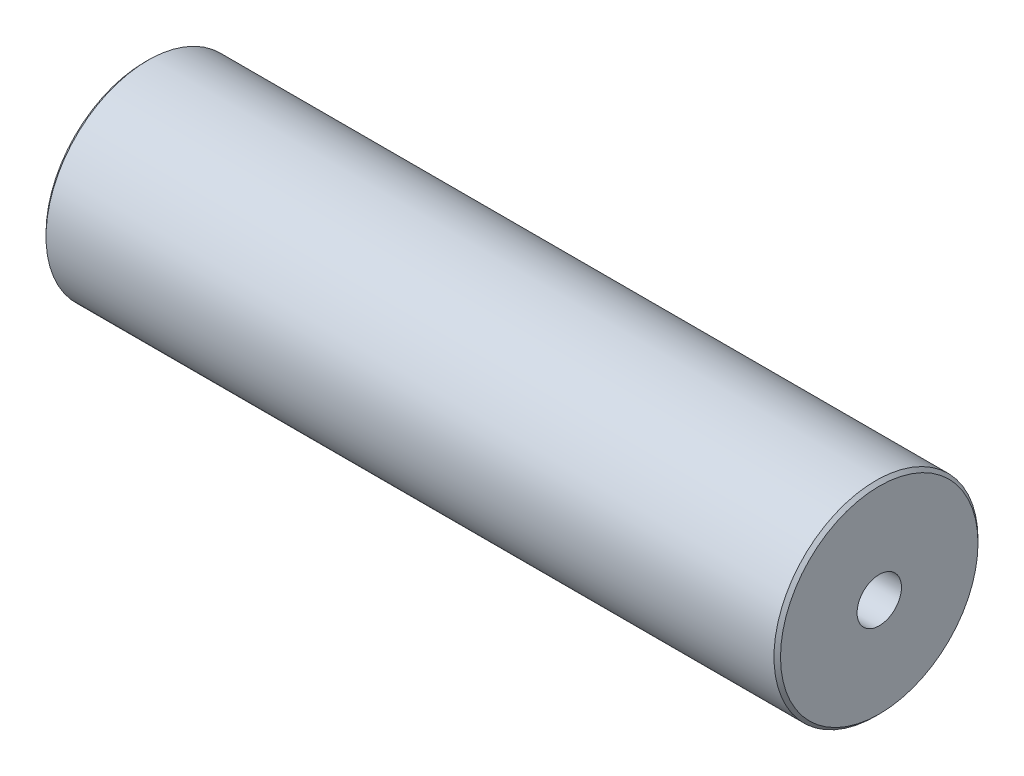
from build123d import *

# Parameters (mm, degrees)
SKETCH1_R           = 7.9375
BOSS_EXTRUDE1_DEPTH = 28.575
CHAMFER1_SIZE       = 0.254


with BuildPart() as part:
    # Sketch1 → Boss-Extrude1 (new, symmetric)
    with BuildSketch(Plane(origin=(0, 0, 0), x_dir=(0, 0, -1), z_dir=(1, 0, 0))):
        Circle(SKETCH1_R)
    extrude(amount=BOSS_EXTRUDE1_DEPTH, both=True)

    # Sketch2 → 8-32 Tapped Hole1 (revolve, cut)
    with BuildSketch(Plane(origin=(28.575, 0, 0), x_dir=(0, 0, -1), z_dir=(0, 1, 0))):
        Polygon((0, 0), (0, 11.756606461), (1.7272, 10.7188), (1.7272, 0), align=None)
    f_8_32_tapped_hole1 = revolve(axis=Axis((34.925, 0, 0), (-1, 0, 0)), mode=Mode.SUBTRACT)

    # Mirror1: 8-32 Tapped Hole1 across plane
    add(f_8_32_tapped_hole1.mirror(Plane(origin=(0, 0, 0), x_dir=(0, 0, 1), z_dir=(1, 0, 0))), mode=Mode.SUBTRACT)

    # Chamfer1
    chamfer1_edges = [part.edges().sort_by_distance(p)[0] for p in [
        (-28.575, 0, 7.9375),
        (28.575, 0, 7.9375),
    ]]
    chamfer(chamfer1_edges, length=CHAMFER1_SIZE)


solid = part.part
